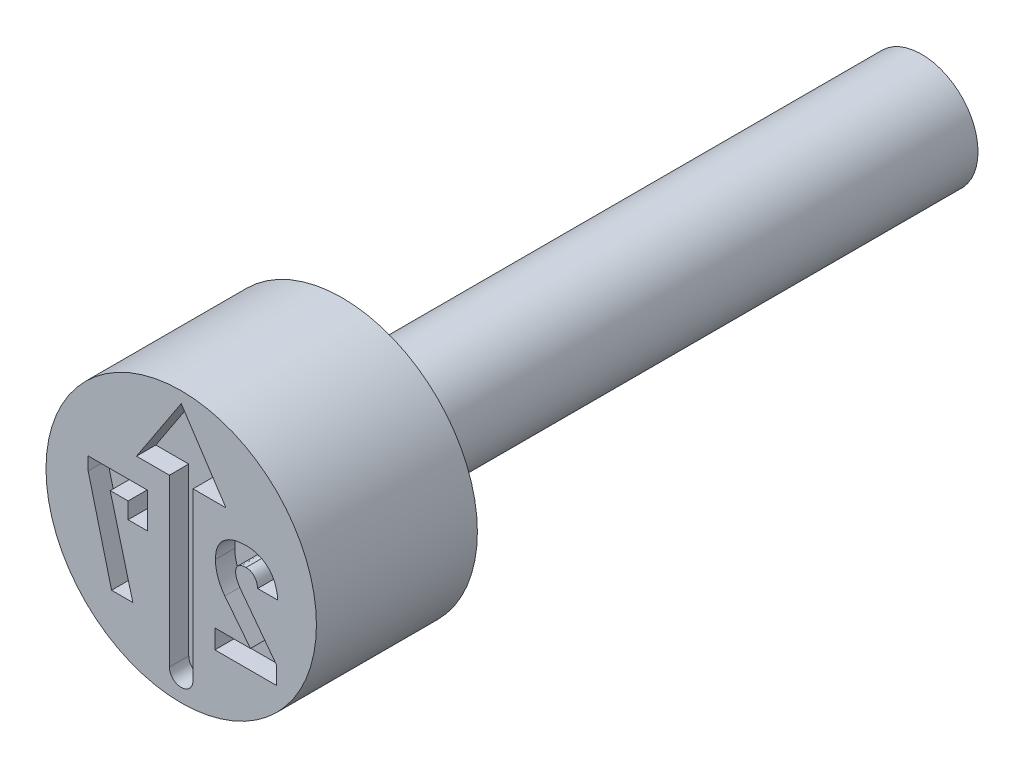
from build123d import *

# Parameters (mm, degrees)
CUT_EXTRUDE4_DEPTH = 0.6
CUT_EXTRUDE5_DEPTH = 0.6


with BuildPart() as part:
    # Sketch2 → Revolve1 (revolve)
    with BuildSketch(Plane(origin=(0, 0, 0), x_dir=(0, 0, -1), z_dir=(1, 0, 0)), mode=Mode.PRIVATE) as revolve1_sk:
        Polygon((0, 4.2), (0, 0), (23, 0), (23, 1.75), (5, 1.75), (5, 4.2), align=None)
    revolve(revolve1_sk.sketch.rotate(Axis((0, 0, -0.403888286), (0, 0, -1)), 90), axis=Axis((0, 0, -0.403888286), (0, 0, -1)))

    # Sketch3 → Cut-Extrude4 (cut)
    with BuildSketch(Plane.XY):
        with BuildLine():
            Line((0.366422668, 1.743593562), (0.366422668, -3.416891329))
            ThreePointArc((0.366422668, -3.416891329), (0, -3.783313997), (-0.366422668, -3.416891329))
            Line((-0.366422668, -3.416891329), (-0.366422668, 1.743593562))
            Line((-0.366422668, 1.743593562), (-1.388789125, 1.743593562))
            Line((-1.388789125, 1.743593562), (0, 3.851569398))
            Line((0, 3.851569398), (1.388789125, 1.743593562))
            Line((1.388789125, 1.743593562), (0.366422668, 1.743593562))
        make_face()
    extrude(amount=-CUT_EXTRUDE4_DEPTH, mode=Mode.SUBTRACT)

    # Sketch4 → Cut-Extrude5 (cut)
    with BuildSketch(Plane.XY):
        with BuildLine():
            Line((2.959283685, -2.25), (2.959283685, -1.697341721))
            Line((2.959283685, -1.697341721), (1.848691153, -0.226004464))
            add(Edge.make_bspline(
                [(1.848691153, -0.226004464), (1.825429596, -0.193227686), (1.78010516, -0.129363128), (1.739083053, -0.041658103), (1.713527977, 0.027103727), (1.701348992, 0.076969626), (1.692660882, 0.124546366), (1.691591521, 0.155808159), (1.691071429, 0.171012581)],
                knots=[0, 0, 0, 0, 1.664252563, 3.24274559, 3.998498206, 4.704056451, 5.369707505, 6, 6, 6, 6], degree=3))
            Line((1.691071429, 0.171012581), (1.691071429, 0.175629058))
            add(Edge.make_bspline(
                [(1.691071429, 0.175629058), (1.69197234, 0.196409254), (1.693698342, 0.236220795), (1.709959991, 0.292316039), (1.73661196, 0.341166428), (1.774784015, 0.381516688), (1.822305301, 0.413431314), (1.879165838, 0.435922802), (1.944621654, 0.448820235), (1.991081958, 0.45044385), (2.015543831, 0.451298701)],
                knots=[0, 0, 0, 0, 1.029992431, 1.973301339, 2.872554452, 3.768620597, 4.704316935, 5.693697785, 6.785705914, 8, 8, 8, 8], degree=3))
            add(Edge.make_bspline(
                [(2.015543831, 0.451298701), (2.039436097, 0.45036642), (2.085859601, 0.448554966), (2.151579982, 0.42847894), (2.210800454, 0.396988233), (2.261853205, 0.352054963), (2.30412875, 0.295639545), (2.338439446, 0.229205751), (2.361743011, 0.151554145), (2.369986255, 0.095968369), (2.374310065, 0.066812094)],
                knots=[0, 0, 0, 0, 0.980828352, 1.905783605, 2.800718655, 3.724477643, 4.680224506, 5.688112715, 6.78735127, 8, 8, 8, 8], degree=3))
            Line((2.374310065, 0.066812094), (2.374310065, 0.064833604))
            Line((2.374310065, 0.064833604), (2.999512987, 0.064833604))
            Line((2.999512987, 0.064833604), (2.999512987, 0.066812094))
            add(Edge.make_bspline(
                [(2.999512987, 0.066812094), (2.996428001, 0.104484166), (2.990406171, 0.178019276), (2.970663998, 0.284391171), (2.945148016, 0.384586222), (2.912688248, 0.478584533), (2.870977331, 0.565297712), (2.824113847, 0.646538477), (2.767748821, 0.719794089), (2.706049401, 0.78751582), (2.637327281, 0.847164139), (2.56405062, 0.899781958), (2.485111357, 0.94356851), (2.401709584, 0.979892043), (2.312920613, 1.007460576), (2.219904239, 1.028111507), (2.121592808, 1.040020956), (2.054485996, 1.041467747), (2.020160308, 1.042207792)],
                knots=[0, 0, 0, 0, 1.173229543, 2.290119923, 3.354877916, 4.382703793, 5.372196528, 6.339367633, 7.289741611, 8.236749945, 9.180232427, 10.11040526, 11.033485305, 11.978374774, 12.930610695, 13.916256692, 14.93414813, 16, 16, 16, 16], degree=3))
            add(Edge.make_bspline(
                [(2.020160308, 1.042207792), (1.983198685, 1.041682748), (1.911313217, 1.040661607), (1.806660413, 1.029638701), (1.708193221, 1.01300192), (1.616070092, 0.988663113), (1.530660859, 0.95691529), (1.451709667, 0.918635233), (1.379051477, 0.873496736), (1.313242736, 0.821403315), (1.254031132, 0.763301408), (1.203065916, 0.698601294), (1.158947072, 0.628610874), (1.124459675, 0.551972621), (1.096066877, 0.470488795), (1.07768298, 0.38269881), (1.065294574, 0.289636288), (1.063929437, 0.225574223), (1.063230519, 0.192775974)],
                knots=[0, 0, 0, 0, 1.219700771, 2.37215663, 3.469774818, 4.513610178, 5.512457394, 6.473141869, 7.405450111, 8.330272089, 9.238546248, 10.1372905, 11.043445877, 11.962355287, 12.905558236, 13.886315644, 14.917844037, 16, 16, 16, 16], degree=3))
            Line((1.063230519, 0.192775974), (1.063230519, 0.190137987))
            add(Edge.make_bspline(
                [(1.063230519, 0.190137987), (1.064071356, 0.153159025), (1.065754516, 0.079135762), (1.08094773, -0.031650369), (1.105431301, -0.141870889), (1.139055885, -0.250993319), (1.180826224, -0.357127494), (1.230958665, -0.458819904), (1.287539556, -0.556115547), (1.332374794, -0.616165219), (1.354728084, -0.646103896)],
                knots=[0, 0, 0, 0, 0.984368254, 1.970475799, 2.971844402, 3.988480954, 5.008197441, 6.005725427, 7.005724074, 8, 8, 8, 8], degree=3))
            Line((1.354728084, -0.646103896), (2.151400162, -1.659090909))
            Line((2.151400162, -1.659090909), (1.045424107, -1.659090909))
            Line((1.045424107, -1.659090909), (1.045424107, -2.25))
            Line((1.045424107, -2.25), (2.959283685, -2.25))
        make_face()
        Polygon((-2.889001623, 1), (-2.889001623, 0.592431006), (-2.163555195, -2.25), (-1.502739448, -2.25), (-2.205762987, 0.409090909), (-1.649807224, 0.409090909), (-1.649807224, -0.097402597), (-1.039772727, -0.097402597), (-1.039772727, 1), align=None)
    extrude(amount=-CUT_EXTRUDE5_DEPTH, mode=Mode.SUBTRACT)


solid = part.part
